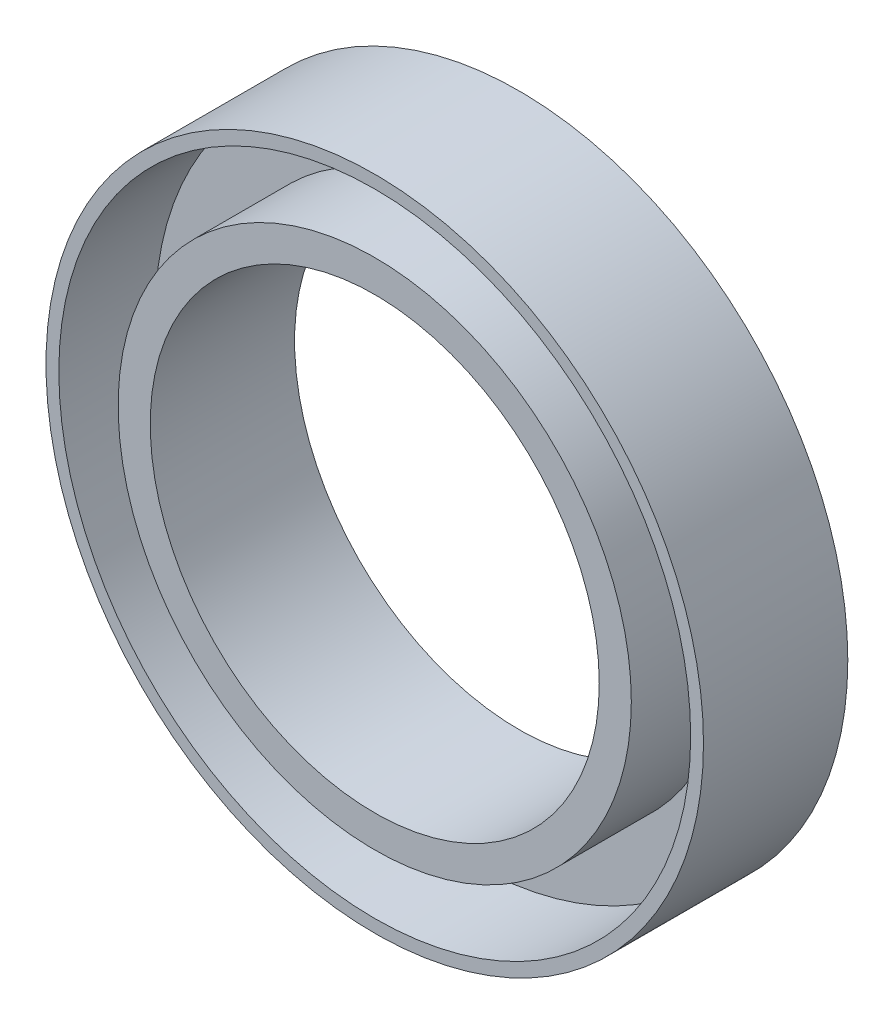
from build123d import *

# Parameters (mm, degrees)
ESQUISSE1_R        = 10.25
ESQUISSE1_R_2      = 7
BOSS_EXTRU_1_DEPTH = 1.5
ESQUISSE2_R        = 8
ESQUISSE2_R_2      = 7
BOSS_EXTRU_2_DEPTH = 3
ESQUISSE3_R        = 10.25
ESQUISSE3_R_2      = 9.85
BOSS_EXTRU_3_DEPTH = 3


with BuildPart() as part:
    # Esquisse1 → Boss.-Extru.1 (new body)
    with BuildSketch(Plane.XY):
        Circle(ESQUISSE1_R)
        Circle(ESQUISSE1_R_2, mode=Mode.SUBTRACT)
    extrude(amount=BOSS_EXTRU_1_DEPTH)

    # Esquisse2 → Boss.-Extru.2 (add)
    with BuildSketch(Plane.XY.offset(1.5)):
        Circle(ESQUISSE2_R)
        Circle(ESQUISSE2_R_2, mode=Mode.SUBTRACT)
    extrude(amount=BOSS_EXTRU_2_DEPTH)

    # Esquisse3 → Boss.-Extru.3 (add)
    with BuildSketch(Plane.XY.offset(1.5)):
        Circle(ESQUISSE3_R)
        Circle(ESQUISSE3_R_2, mode=Mode.SUBTRACT)
    extrude(amount=BOSS_EXTRU_3_DEPTH)


solid = part.part
